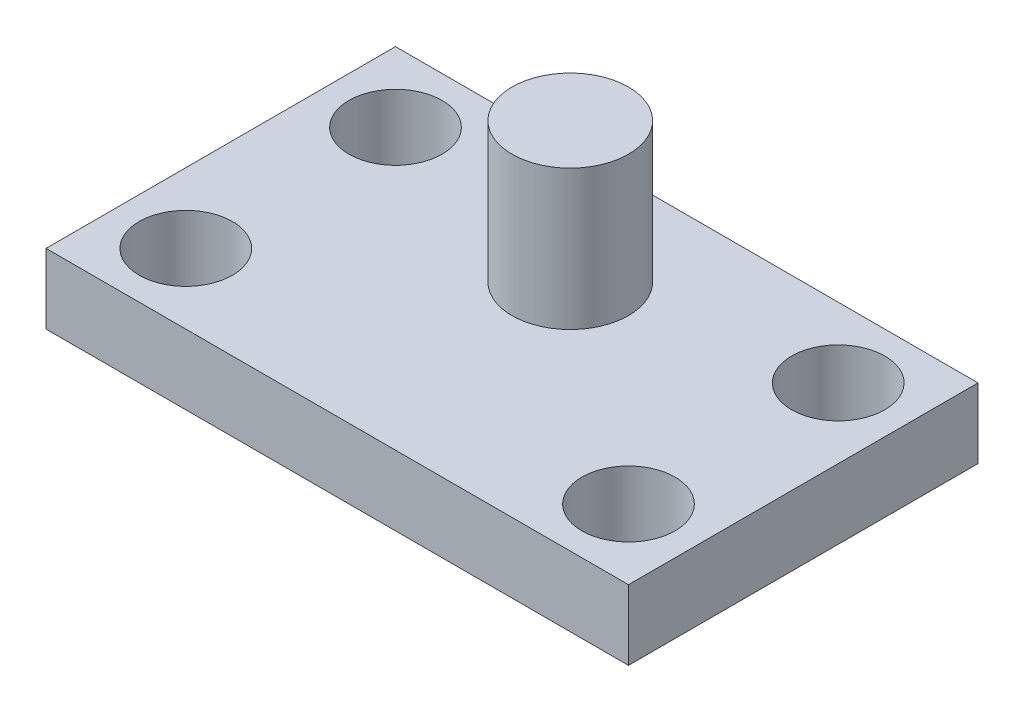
from build123d import *

# Parameters (mm, degrees)
SKETCH1_W           = 250
SKETCH1_H           = 150
SKETCH1_R           = 20
BOSS_EXTRUDE1_DEPTH = 30
SKETCH2_R           = 25
BOSS_EXTRUDE2_DEPTH = 90


with BuildPart() as part:
    # Sketch1 → Boss-Extrude1 (new body)
    with BuildSketch(Plane(origin=(0, 0, 0), x_dir=(1, 0, 0), z_dir=(0, 1, 0))):
        with Locations((125, 75)):
            Rectangle(SKETCH1_W, SKETCH1_H)
        with Locations(Location((30, 120, 0), (0, 0, 270))):
            Circle(SKETCH1_R, mode=Mode.SUBTRACT)
        with Locations(Location((30, 30, 0), (0, 0, 270))):
            Circle(SKETCH1_R, mode=Mode.SUBTRACT)
        with Locations(Location((220, 30, 0), (0, 0, 270))):
            Circle(SKETCH1_R, mode=Mode.SUBTRACT)
        with Locations(Location((220, 120, 0), (0, 0, 270))):
            Circle(SKETCH1_R, mode=Mode.SUBTRACT)
    extrude(amount=BOSS_EXTRUDE1_DEPTH)

    # Sketch2 → Boss-Extrude2 (add)
    with BuildSketch(Plane.XZ):
        with Locations(Location((125, -100, 0), (0, 0, 270))):
            Circle(SKETCH2_R)
    extrude(amount=-BOSS_EXTRUDE2_DEPTH)


solid = part.part
